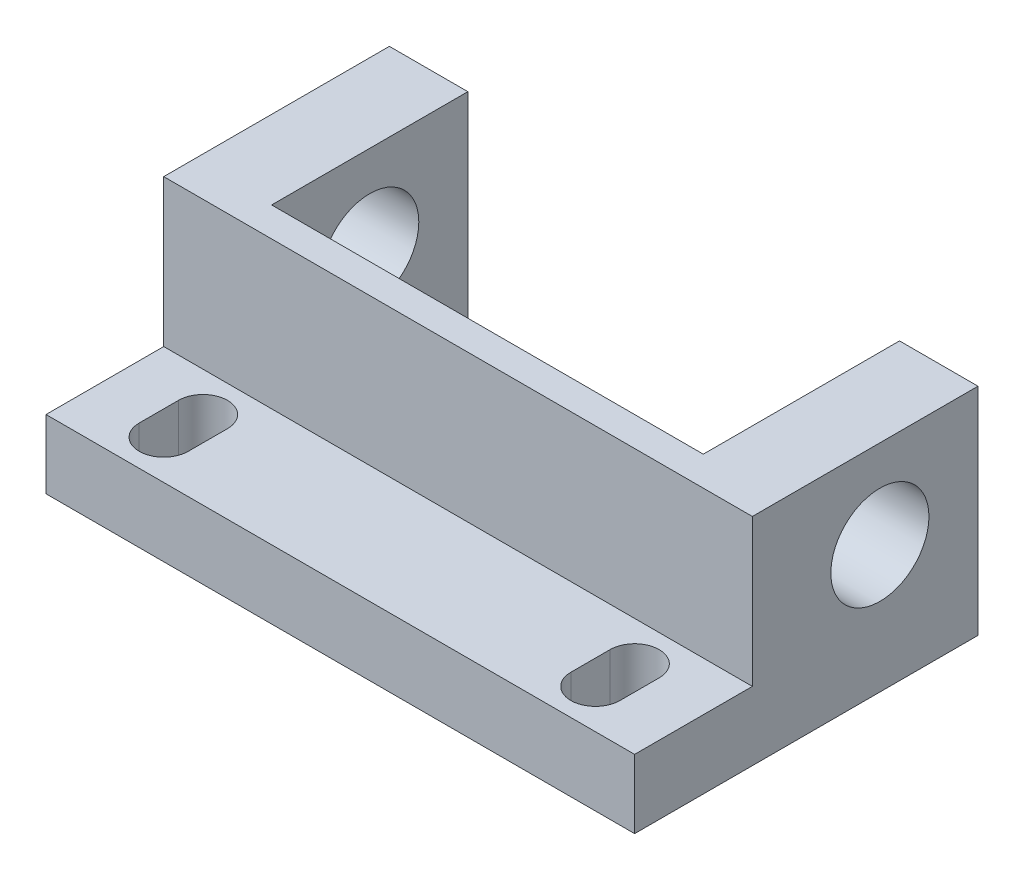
ISO-10303-21;
HEADER;
FILE_DESCRIPTION(('STEP AP214'),'2;1');
FILE_NAME('part.step','',(''),(''),'','','');
FILE_SCHEMA(('AUTOMOTIVE_DESIGN { 1 0 10303 214 1 1 1 1 }'));
ENDSEC;
DATA;
#1=APPLICATION_CONTEXT('core data for automotive mechanical design processes');
#2=APPLICATION_PROTOCOL_DEFINITION('international standard','automotive_design',2000,#1);
#3=PRODUCT_CONTEXT('',#1,'mechanical');
#4=PRODUCT('Part','Part','',(#3));
#5=PRODUCT_RELATED_PRODUCT_CATEGORY('part','',(#4));
#6=PRODUCT_DEFINITION_FORMATION('','',#4);
#7=PRODUCT_DEFINITION_CONTEXT('part definition',#1,'design');
#8=PRODUCT_DEFINITION('design','',#6,#7);
#9=PRODUCT_DEFINITION_SHAPE('','',#8);
#10=(LENGTH_UNIT() NAMED_UNIT(*) SI_UNIT(.MILLI.,.METRE.));
#11=(NAMED_UNIT(*) PLANE_ANGLE_UNIT() SI_UNIT($,.RADIAN.));
#12=(NAMED_UNIT(*) SI_UNIT($,.STERADIAN.) SOLID_ANGLE_UNIT());
#13=UNCERTAINTY_MEASURE_WITH_UNIT(LENGTH_MEASURE(1.E-05),#10,'distance_accuracy_value','');
#14=(GEOMETRIC_REPRESENTATION_CONTEXT(3) GLOBAL_UNCERTAINTY_ASSIGNED_CONTEXT((#13)) GLOBAL_UNIT_ASSIGNED_CONTEXT((#10,
#11,#12)) REPRESENTATION_CONTEXT('',''));
#15=CARTESIAN_POINT('',(0.,0.,0.));
#16=DIRECTION('',(0.,0.,1.));
#17=DIRECTION('',(1.,0.,0.));
#18=AXIS2_PLACEMENT_3D('',#15,#16,#17);
#19=CARTESIAN_POINT('',(30.,0.,-35.));
#20=DIRECTION('',(0.,0.,1.));
#21=DIRECTION('',(1.,0.,0.));
#22=AXIS2_PLACEMENT_3D('',#19,#20,#21);
#23=PLANE('',#22);
#24=DIRECTION('',(-1.,0.,0.));
#25=VECTOR('',#24,1.);
#26=CARTESIAN_POINT('',(30.,22.,-35.));
#27=LINE('',#26,#25);
#28=CARTESIAN_POINT('',(-22.,22.,-35.));
#29=VERTEX_POINT('',#28);
#30=CARTESIAN_POINT('',(-30.,22.,-35.));
#31=VERTEX_POINT('',#30);
#32=EDGE_CURVE('E290',#29,#31,#27,.T.);
#33=ORIENTED_EDGE('',*,*,#32,.F.);
#34=DIRECTION('',(0.,1.,0.));
#35=VECTOR('',#34,1.);
#36=CARTESIAN_POINT('',(-22.,0.,-35.));
#37=LINE('',#36,#35);
#38=CARTESIAN_POINT('',(-22.,0.,-35.));
#39=VERTEX_POINT('',#38);
#40=EDGE_CURVE('E270',#39,#29,#37,.T.);
#41=ORIENTED_EDGE('',*,*,#40,.F.);
#42=DIRECTION('',(-1.,0.,0.));
#43=VECTOR('',#42,1.);
#44=CARTESIAN_POINT('',(30.,0.,-35.));
#45=LINE('',#44,#43);
#46=CARTESIAN_POINT('',(-30.,0.,-35.));
#47=VERTEX_POINT('',#46);
#48=EDGE_CURVE('E303',#39,#47,#45,.T.);
#49=ORIENTED_EDGE('',*,*,#48,.T.);
#50=DIRECTION('',(0.,1.,0.));
#51=VECTOR('',#50,1.);
#52=CARTESIAN_POINT('',(-30.,0.,-35.));
#53=LINE('',#52,#51);
#54=EDGE_CURVE('E295',#47,#31,#53,.T.);
#55=ORIENTED_EDGE('',*,*,#54,.T.);
#56=EDGE_LOOP('',(#33,#41,#49,#55));
#57=FACE_BOUND('',#56,.T.);
#58=ADVANCED_FACE('F32',(#57),#23,.F.);
#59=CARTESIAN_POINT('',(30.,0.,0.));
#60=DIRECTION('',(0.,0.,-1.));
#61=DIRECTION('',(-1.,0.,0.));
#62=AXIS2_PLACEMENT_3D('',#59,#60,#61);
#63=PLANE('',#62);
#64=DIRECTION('',(0.,-1.,0.));
#65=VECTOR('',#64,1.);
#66=CARTESIAN_POINT('',(30.,0.,0.));
#67=LINE('',#66,#65);
#68=CARTESIAN_POINT('',(30.,7.,0.));
#69=VERTEX_POINT('',#68);
#70=CARTESIAN_POINT('',(30.,0.,0.));
#71=VERTEX_POINT('',#70);
#72=EDGE_CURVE('E280',#69,#71,#67,.T.);
#73=ORIENTED_EDGE('',*,*,#72,.F.);
#74=DIRECTION('',(1.,0.,0.));
#75=VECTOR('',#74,1.);
#76=CARTESIAN_POINT('',(-30.,7.,0.));
#77=LINE('',#76,#75);
#78=CARTESIAN_POINT('',(-30.,7.,0.));
#79=VERTEX_POINT('',#78);
#80=EDGE_CURVE('E234',#79,#69,#77,.T.);
#81=ORIENTED_EDGE('',*,*,#80,.F.);
#82=DIRECTION('',(0.,-1.,0.));
#83=VECTOR('',#82,1.);
#84=CARTESIAN_POINT('',(-30.,0.,0.));
#85=LINE('',#84,#83);
#86=CARTESIAN_POINT('',(-30.,0.,0.));
#87=VERTEX_POINT('',#86);
#88=EDGE_CURVE('E272',#79,#87,#85,.T.);
#89=ORIENTED_EDGE('',*,*,#88,.T.);
#90=DIRECTION('',(-1.,0.,0.));
#91=VECTOR('',#90,1.);
#92=CARTESIAN_POINT('',(30.,0.,0.));
#93=LINE('',#92,#91);
#94=EDGE_CURVE('E11',#71,#87,#93,.T.);
#95=ORIENTED_EDGE('',*,*,#94,.F.);
#96=EDGE_LOOP('',(#73,#81,#89,#95));
#97=FACE_BOUND('',#96,.T.);
#98=ADVANCED_FACE('F34',(#97),#63,.F.);
#99=CARTESIAN_POINT('',(30.,0.,0.));
#100=DIRECTION('',(0.,1.,0.));
#101=DIRECTION('',(0.,0.,1.));
#102=AXIS2_PLACEMENT_3D('',#99,#100,#101);
#103=PLANE('',#102);
#104=DIRECTION('',(0.,0.,1.));
#105=VECTOR('',#104,1.);
#106=CARTESIAN_POINT('',(19.5,0.,-4.));
#107=LINE('',#106,#105);
#108=CARTESIAN_POINT('',(19.5,0.,-8.));
#109=VERTEX_POINT('',#108);
#110=CARTESIAN_POINT('',(19.5,0.,-4.));
#111=VERTEX_POINT('',#110);
#112=EDGE_CURVE('E166',#109,#111,#107,.T.);
#113=ORIENTED_EDGE('',*,*,#112,.T.);
#114=CARTESIAN_POINT('',(22.,0.,-4.));
#115=DIRECTION('',(0.,1.,0.));
#116=DIRECTION('',(0.,0.,1.));
#117=AXIS2_PLACEMENT_3D('',#114,#115,#116);
#118=CIRCLE('',#117,2.5);
#119=CARTESIAN_POINT('',(24.5,0.,-4.));
#120=VERTEX_POINT('',#119);
#121=EDGE_CURVE('E160',#111,#120,#118,.T.);
#122=ORIENTED_EDGE('',*,*,#121,.T.);
#123=DIRECTION('',(0.,0.,-1.));
#124=VECTOR('',#123,1.);
#125=CARTESIAN_POINT('',(24.5,0.,-4.));
#126=LINE('',#125,#124);
#127=CARTESIAN_POINT('',(24.5,0.,-8.));
#128=VERTEX_POINT('',#127);
#129=EDGE_CURVE('E169',#120,#128,#126,.T.);
#130=ORIENTED_EDGE('',*,*,#129,.T.);
#131=CARTESIAN_POINT('',(22.,0.,-8.));
#132=DIRECTION('',(0.,1.,0.));
#133=DIRECTION('',(0.,0.,1.));
#134=AXIS2_PLACEMENT_3D('',#131,#132,#133);
#135=CIRCLE('',#134,2.5);
#136=EDGE_CURVE('E48',#128,#109,#135,.T.);
#137=ORIENTED_EDGE('',*,*,#136,.T.);
#138=EDGE_LOOP('',(#113,#122,#130,#137));
#139=FACE_BOUND('',#138,.T.);
#140=DIRECTION('',(0.,0.,1.));
#141=VECTOR('',#140,1.);
#142=CARTESIAN_POINT('',(-24.5,0.,-4.));
#143=LINE('',#142,#141);
#144=CARTESIAN_POINT('',(-24.5,0.,-8.));
#145=VERTEX_POINT('',#144);
#146=CARTESIAN_POINT('',(-24.5,0.,-4.));
#147=VERTEX_POINT('',#146);
#148=EDGE_CURVE('E205',#145,#147,#143,.T.);
#149=ORIENTED_EDGE('',*,*,#148,.T.);
#150=CARTESIAN_POINT('',(-22.,0.,-4.));
#151=DIRECTION('',(0.,1.,0.));
#152=DIRECTION('',(0.,0.,1.));
#153=AXIS2_PLACEMENT_3D('',#150,#151,#152);
#154=CIRCLE('',#153,2.5);
#155=CARTESIAN_POINT('',(-19.5,0.,-4.));
#156=VERTEX_POINT('',#155);
#157=EDGE_CURVE('E195',#147,#156,#154,.T.);
#158=ORIENTED_EDGE('',*,*,#157,.T.);
#159=DIRECTION('',(0.,0.,-1.));
#160=VECTOR('',#159,1.);
#161=CARTESIAN_POINT('',(-19.5,0.,-4.));
#162=LINE('',#161,#160);
#163=CARTESIAN_POINT('',(-19.5,0.,-8.));
#164=VERTEX_POINT('',#163);
#165=EDGE_CURVE('E198',#156,#164,#162,.T.);
#166=ORIENTED_EDGE('',*,*,#165,.T.);
#167=CARTESIAN_POINT('',(-22.,0.,-8.));
#168=DIRECTION('',(0.,1.,0.));
#169=DIRECTION('',(0.,0.,1.));
#170=AXIS2_PLACEMENT_3D('',#167,#168,#169);
#171=CIRCLE('',#170,2.5);
#172=EDGE_CURVE('E202',#164,#145,#171,.T.);
#173=ORIENTED_EDGE('',*,*,#172,.T.);
#174=EDGE_LOOP('',(#149,#158,#166,#173));
#175=FACE_BOUND('',#174,.T.);
#176=ORIENTED_EDGE('',*,*,#48,.F.);
#177=DIRECTION('',(0.,0.,1.));
#178=VECTOR('',#177,1.);
#179=CARTESIAN_POINT('',(-22.,0.,-35.));
#180=LINE('',#179,#178);
#181=CARTESIAN_POINT('',(-22.,0.,-15.));
#182=VERTEX_POINT('',#181);
#183=EDGE_CURVE('E254',#39,#182,#180,.T.);
#184=ORIENTED_EDGE('',*,*,#183,.T.);
#185=DIRECTION('',(1.,0.,0.));
#186=VECTOR('',#185,1.);
#187=CARTESIAN_POINT('',(-22.,0.,-15.));
#188=LINE('',#187,#186);
#189=CARTESIAN_POINT('',(22.,0.,-15.));
#190=VERTEX_POINT('',#189);
#191=EDGE_CURVE('E257',#182,#190,#188,.T.);
#192=ORIENTED_EDGE('',*,*,#191,.T.);
#193=DIRECTION('',(0.,0.,-1.));
#194=VECTOR('',#193,1.);
#195=CARTESIAN_POINT('',(22.,0.,-35.));
#196=LINE('',#195,#194);
#197=CARTESIAN_POINT('',(22.,0.,-35.));
#198=VERTEX_POINT('',#197);
#199=EDGE_CURVE('E261',#190,#198,#196,.T.);
#200=ORIENTED_EDGE('',*,*,#199,.T.);
#201=CARTESIAN_POINT('',(30.,0.,-35.));
#202=VERTEX_POINT('',#201);
#203=EDGE_CURVE('E41',#202,#198,#45,.T.);
#204=ORIENTED_EDGE('',*,*,#203,.F.);
#205=DIRECTION('',(0.,0.,-1.));
#206=VECTOR('',#205,1.);
#207=CARTESIAN_POINT('',(30.,0.,0.));
#208=LINE('',#207,#206);
#209=EDGE_CURVE('E282',#71,#202,#208,.T.);
#210=ORIENTED_EDGE('',*,*,#209,.F.);
#211=ORIENTED_EDGE('',*,*,#94,.T.);
#212=DIRECTION('',(0.,0.,-1.));
#213=VECTOR('',#212,1.);
#214=CARTESIAN_POINT('',(-30.,0.,0.));
#215=LINE('',#214,#213);
#216=EDGE_CURVE('E292',#87,#47,#215,.T.);
#217=ORIENTED_EDGE('',*,*,#216,.T.);
#218=EDGE_LOOP('',(#176,#184,#192,#200,#204,#210,#211,#217));
#219=FACE_BOUND('',#218,.T.);
#220=ADVANCED_FACE('F173',(#139,#175,#219),#103,.F.);
#221=ORIENTED_EDGE('',*,*,#203,.T.);
#222=DIRECTION('',(0.,1.,0.));
#223=VECTOR('',#222,1.);
#224=CARTESIAN_POINT('',(22.,0.,-35.));
#225=LINE('',#224,#223);
#226=CARTESIAN_POINT('',(22.,22.,-35.));
#227=VERTEX_POINT('',#226);
#228=EDGE_CURVE('E273',#198,#227,#225,.T.);
#229=ORIENTED_EDGE('',*,*,#228,.T.);
#230=CARTESIAN_POINT('',(30.,22.,-35.));
#231=VERTEX_POINT('',#230);
#232=EDGE_CURVE('E300',#231,#227,#27,.T.);
#233=ORIENTED_EDGE('',*,*,#232,.F.);
#234=DIRECTION('',(0.,1.,0.));
#235=VECTOR('',#234,1.);
#236=CARTESIAN_POINT('',(30.,0.,-35.));
#237=LINE('',#236,#235);
#238=EDGE_CURVE('E285',#202,#231,#237,.T.);
#239=ORIENTED_EDGE('',*,*,#238,.F.);
#240=EDGE_LOOP('',(#221,#229,#233,#239));
#241=FACE_BOUND('',#240,.T.);
#242=ADVANCED_FACE('F337',(#241),#23,.F.);
#243=CARTESIAN_POINT('',(30.,22.,0.));
#244=DIRECTION('',(0.,-1.,0.));
#245=DIRECTION('',(0.,0.,-1.));
#246=AXIS2_PLACEMENT_3D('',#243,#244,#245);
#247=PLANE('',#246);
#248=DIRECTION('',(0.,0.,1.));
#249=VECTOR('',#248,1.);
#250=CARTESIAN_POINT('',(-30.,22.,0.));
#251=LINE('',#250,#249);
#252=CARTESIAN_POINT('',(-30.,22.,-12.));
#253=VERTEX_POINT('',#252);
#254=EDGE_CURVE('E283',#31,#253,#251,.T.);
#255=ORIENTED_EDGE('',*,*,#254,.T.);
#256=DIRECTION('',(1.,0.,0.));
#257=VECTOR('',#256,1.);
#258=CARTESIAN_POINT('',(-30.,22.,-12.));
#259=LINE('',#258,#257);
#260=CARTESIAN_POINT('',(30.,22.,-12.));
#261=VERTEX_POINT('',#260);
#262=EDGE_CURVE('E238',#253,#261,#259,.T.);
#263=ORIENTED_EDGE('',*,*,#262,.T.);
#264=DIRECTION('',(0.,0.,1.));
#265=VECTOR('',#264,1.);
#266=CARTESIAN_POINT('',(30.,22.,0.));
#267=LINE('',#266,#265);
#268=EDGE_CURVE('E287',#231,#261,#267,.T.);
#269=ORIENTED_EDGE('',*,*,#268,.F.);
#270=ORIENTED_EDGE('',*,*,#232,.T.);
#271=DIRECTION('',(0.,0.,-1.));
#272=VECTOR('',#271,1.);
#273=CARTESIAN_POINT('',(22.,22.,-35.));
#274=LINE('',#273,#272);
#275=CARTESIAN_POINT('',(22.,22.,-15.));
#276=VERTEX_POINT('',#275);
#277=EDGE_CURVE('E258',#276,#227,#274,.T.);
#278=ORIENTED_EDGE('',*,*,#277,.F.);
#279=DIRECTION('',(1.,0.,0.));
#280=VECTOR('',#279,1.);
#281=CARTESIAN_POINT('',(-22.,22.,-15.));
#282=LINE('',#281,#280);
#283=CARTESIAN_POINT('',(-22.,22.,-15.));
#284=VERTEX_POINT('',#283);
#285=EDGE_CURVE('E266',#284,#276,#282,.T.);
#286=ORIENTED_EDGE('',*,*,#285,.F.);
#287=DIRECTION('',(0.,0.,1.));
#288=VECTOR('',#287,1.);
#289=CARTESIAN_POINT('',(-22.,22.,-35.));
#290=LINE('',#289,#288);
#291=EDGE_CURVE('E253',#29,#284,#290,.T.);
#292=ORIENTED_EDGE('',*,*,#291,.F.);
#293=ORIENTED_EDGE('',*,*,#32,.T.);
#294=EDGE_LOOP('',(#255,#263,#269,#270,#278,#286,#292,#293));
#295=FACE_BOUND('',#294,.T.);
#296=ADVANCED_FACE('F323',(#295),#247,.F.);
#297=CARTESIAN_POINT('',(30.,0.,0.));
#298=DIRECTION('',(-1.,0.,0.));
#299=DIRECTION('',(0.,0.,1.));
#300=AXIS2_PLACEMENT_3D('',#297,#298,#299);
#301=PLANE('',#300);
#302=CARTESIAN_POINT('',(30.,13.,-25.));
#303=DIRECTION('',(1.,0.,0.));
#304=DIRECTION('',(0.,0.,-1.));
#305=AXIS2_PLACEMENT_3D('',#302,#303,#304);
#306=CIRCLE('',#305,5.);
#307=CARTESIAN_POINT('',(30.,13.,-30.));
#308=VERTEX_POINT('',#307);
#309=EDGE_CURVE('E241',#308,#308,#306,.T.);
#310=ORIENTED_EDGE('',*,*,#309,.F.);
#311=EDGE_LOOP('',(#310));
#312=FACE_BOUND('',#311,.T.);
#313=ORIENTED_EDGE('',*,*,#268,.T.);
#314=DIRECTION('',(0.,1.,0.));
#315=VECTOR('',#314,1.);
#316=CARTESIAN_POINT('',(30.,7.,-12.));
#317=LINE('',#316,#315);
#318=CARTESIAN_POINT('',(30.,7.,-12.));
#319=VERTEX_POINT('',#318);
#320=EDGE_CURVE('E231',#319,#261,#317,.T.);
#321=ORIENTED_EDGE('',*,*,#320,.F.);
#322=DIRECTION('',(0.,0.,-1.));
#323=VECTOR('',#322,1.);
#324=CARTESIAN_POINT('',(30.,7.,0.));
#325=LINE('',#324,#323);
#326=EDGE_CURVE('E220',#69,#319,#325,.T.);
#327=ORIENTED_EDGE('',*,*,#326,.F.);
#328=ORIENTED_EDGE('',*,*,#72,.T.);
#329=ORIENTED_EDGE('',*,*,#209,.T.);
#330=ORIENTED_EDGE('',*,*,#238,.T.);
#331=EDGE_LOOP('',(#313,#321,#327,#328,#329,#330));
#332=FACE_BOUND('',#331,.T.);
#333=ADVANCED_FACE('F340',(#312,#332),#301,.F.);
#334=CARTESIAN_POINT('',(-30.,0.,0.));
#335=DIRECTION('',(-1.,0.,0.));
#336=DIRECTION('',(0.,0.,1.));
#337=AXIS2_PLACEMENT_3D('',#334,#335,#336);
#338=PLANE('',#337);
#339=DIRECTION('',(0.,1.,0.));
#340=VECTOR('',#339,1.);
#341=CARTESIAN_POINT('',(-30.,7.,-12.));
#342=LINE('',#341,#340);
#343=CARTESIAN_POINT('',(-30.,7.,-12.));
#344=VERTEX_POINT('',#343);
#345=EDGE_CURVE('E230',#344,#253,#342,.T.);
#346=ORIENTED_EDGE('',*,*,#345,.T.);
#347=ORIENTED_EDGE('',*,*,#254,.F.);
#348=ORIENTED_EDGE('',*,*,#54,.F.);
#349=ORIENTED_EDGE('',*,*,#216,.F.);
#350=ORIENTED_EDGE('',*,*,#88,.F.);
#351=DIRECTION('',(0.,0.,-1.));
#352=VECTOR('',#351,1.);
#353=CARTESIAN_POINT('',(-30.,7.,0.));
#354=LINE('',#353,#352);
#355=EDGE_CURVE('E227',#79,#344,#354,.T.);
#356=ORIENTED_EDGE('',*,*,#355,.T.);
#357=EDGE_LOOP('',(#346,#347,#348,#349,#350,#356));
#358=FACE_BOUND('',#357,.T.);
#359=CARTESIAN_POINT('',(-30.,13.,-25.));
#360=DIRECTION('',(1.,0.,0.));
#361=DIRECTION('',(0.,0.,-1.));
#362=AXIS2_PLACEMENT_3D('',#359,#360,#361);
#363=CIRCLE('',#362,5.);
#364=CARTESIAN_POINT('',(-30.,13.,-30.));
#365=VERTEX_POINT('',#364);
#366=EDGE_CURVE('E245',#365,#365,#363,.T.);
#367=ORIENTED_EDGE('',*,*,#366,.T.);
#368=EDGE_LOOP('',(#367));
#369=FACE_BOUND('',#368,.T.);
#370=ADVANCED_FACE('F320',(#358,#369),#338,.T.);
#371=CARTESIAN_POINT('',(-22.,0.,-35.));
#372=DIRECTION('',(-1.,0.,0.));
#373=DIRECTION('',(0.,0.,1.));
#374=AXIS2_PLACEMENT_3D('',#371,#372,#373);
#375=PLANE('',#374);
#376=CARTESIAN_POINT('',(-22.,13.,-25.));
#377=DIRECTION('',(-1.,0.,0.));
#378=DIRECTION('',(0.,0.,1.));
#379=AXIS2_PLACEMENT_3D('',#376,#377,#378);
#380=CIRCLE('',#379,5.);
#381=CARTESIAN_POINT('',(-22.,13.,-20.));
#382=VERTEX_POINT('',#381);
#383=EDGE_CURVE('E250',#382,#382,#380,.T.);
#384=ORIENTED_EDGE('',*,*,#383,.T.);
#385=EDGE_LOOP('',(#384));
#386=FACE_BOUND('',#385,.T.);
#387=ORIENTED_EDGE('',*,*,#291,.T.);
#388=DIRECTION('',(0.,1.,0.));
#389=VECTOR('',#388,1.);
#390=CARTESIAN_POINT('',(-22.,0.,-15.));
#391=LINE('',#390,#389);
#392=EDGE_CURVE('E264',#182,#284,#391,.T.);
#393=ORIENTED_EDGE('',*,*,#392,.F.);
#394=ORIENTED_EDGE('',*,*,#183,.F.);
#395=ORIENTED_EDGE('',*,*,#40,.T.);
#396=EDGE_LOOP('',(#387,#393,#394,#395));
#397=FACE_BOUND('',#396,.T.);
#398=ADVANCED_FACE('F329',(#386,#397),#375,.F.);
#399=CARTESIAN_POINT('',(22.,0.,-35.));
#400=DIRECTION('',(1.,0.,0.));
#401=DIRECTION('',(0.,0.,-1.));
#402=AXIS2_PLACEMENT_3D('',#399,#400,#401);
#403=PLANE('',#402);
#404=CARTESIAN_POINT('',(22.,13.,-25.));
#405=DIRECTION('',(1.,0.,0.));
#406=DIRECTION('',(0.,0.,-1.));
#407=AXIS2_PLACEMENT_3D('',#404,#405,#406);
#408=CIRCLE('',#407,5.);
#409=CARTESIAN_POINT('',(22.,13.,-30.));
#410=VERTEX_POINT('',#409);
#411=EDGE_CURVE('E36',#410,#410,#408,.T.);
#412=ORIENTED_EDGE('',*,*,#411,.T.);
#413=EDGE_LOOP('',(#412));
#414=FACE_BOUND('',#413,.T.);
#415=ORIENTED_EDGE('',*,*,#277,.T.);
#416=ORIENTED_EDGE('',*,*,#228,.F.);
#417=ORIENTED_EDGE('',*,*,#199,.F.);
#418=DIRECTION('',(0.,1.,0.));
#419=VECTOR('',#418,1.);
#420=CARTESIAN_POINT('',(22.,0.,-15.));
#421=LINE('',#420,#419);
#422=EDGE_CURVE('E276',#190,#276,#421,.T.);
#423=ORIENTED_EDGE('',*,*,#422,.T.);
#424=EDGE_LOOP('',(#415,#416,#417,#423));
#425=FACE_BOUND('',#424,.T.);
#426=ADVANCED_FACE('F335',(#414,#425),#403,.F.);
#427=CARTESIAN_POINT('',(-22.,0.,-15.));
#428=DIRECTION('',(0.,0.,1.));
#429=DIRECTION('',(1.,0.,0.));
#430=AXIS2_PLACEMENT_3D('',#427,#428,#429);
#431=PLANE('',#430);
#432=ORIENTED_EDGE('',*,*,#285,.T.);
#433=ORIENTED_EDGE('',*,*,#422,.F.);
#434=ORIENTED_EDGE('',*,*,#191,.F.);
#435=ORIENTED_EDGE('',*,*,#392,.T.);
#436=EDGE_LOOP('',(#432,#433,#434,#435));
#437=FACE_BOUND('',#436,.T.);
#438=ADVANCED_FACE('F332',(#437),#431,.F.);
#439=CARTESIAN_POINT('',(-30.,13.,-25.));
#440=DIRECTION('',(1.,0.,0.));
#441=DIRECTION('',(0.,0.,-1.));
#442=AXIS2_PLACEMENT_3D('',#439,#440,#441);
#443=CYLINDRICAL_SURFACE('',#442,5.);
#444=ORIENTED_EDGE('',*,*,#309,.T.);
#445=EDGE_LOOP('',(#444));
#446=FACE_BOUND('',#445,.T.);
#447=ORIENTED_EDGE('',*,*,#411,.F.);
#448=EDGE_LOOP('',(#447));
#449=FACE_BOUND('',#448,.T.);
#450=ADVANCED_FACE('F360',(#446,#449),#443,.F.);
#451=ORIENTED_EDGE('',*,*,#366,.F.);
#452=EDGE_LOOP('',(#451));
#453=FACE_BOUND('',#452,.T.);
#454=ORIENTED_EDGE('',*,*,#383,.F.);
#455=EDGE_LOOP('',(#454));
#456=FACE_BOUND('',#455,.T.);
#457=ADVANCED_FACE('F351',(#453,#456),#443,.F.);
#458=CARTESIAN_POINT('',(-30.,7.,-12.));
#459=DIRECTION('',(0.,0.,-1.));
#460=DIRECTION('',(-1.,0.,0.));
#461=AXIS2_PLACEMENT_3D('',#458,#459,#460);
#462=PLANE('',#461);
#463=ORIENTED_EDGE('',*,*,#320,.T.);
#464=ORIENTED_EDGE('',*,*,#262,.F.);
#465=ORIENTED_EDGE('',*,*,#345,.F.);
#466=DIRECTION('',(1.,0.,0.));
#467=VECTOR('',#466,1.);
#468=CARTESIAN_POINT('',(-30.,7.,-12.));
#469=LINE('',#468,#467);
#470=EDGE_CURVE('E242',#344,#319,#469,.T.);
#471=ORIENTED_EDGE('',*,*,#470,.T.);
#472=EDGE_LOOP('',(#463,#464,#465,#471));
#473=FACE_BOUND('',#472,.T.);
#474=ADVANCED_FACE('F349',(#473),#462,.F.);
#475=CARTESIAN_POINT('',(-30.,7.,0.));
#476=DIRECTION('',(0.,-1.,0.));
#477=DIRECTION('',(0.,0.,-1.));
#478=AXIS2_PLACEMENT_3D('',#475,#476,#477);
#479=PLANE('',#478);
#480=DIRECTION('',(0.,0.,-1.));
#481=VECTOR('',#480,1.);
#482=CARTESIAN_POINT('',(24.5,7.,-4.));
#483=LINE('',#482,#481);
#484=CARTESIAN_POINT('',(24.5,7.,-4.));
#485=VERTEX_POINT('',#484);
#486=CARTESIAN_POINT('',(24.5,7.,-8.));
#487=VERTEX_POINT('',#486);
#488=EDGE_CURVE('E185',#485,#487,#483,.T.);
#489=ORIENTED_EDGE('',*,*,#488,.F.);
#490=CARTESIAN_POINT('',(22.,7.,-4.));
#491=DIRECTION('',(0.,1.,0.));
#492=DIRECTION('',(0.,0.,1.));
#493=AXIS2_PLACEMENT_3D('',#490,#491,#492);
#494=CIRCLE('',#493,2.5);
#495=CARTESIAN_POINT('',(19.5,7.,-4.));
#496=VERTEX_POINT('',#495);
#497=EDGE_CURVE('E56',#496,#485,#494,.T.);
#498=ORIENTED_EDGE('',*,*,#497,.F.);
#499=DIRECTION('',(0.,0.,1.));
#500=VECTOR('',#499,1.);
#501=CARTESIAN_POINT('',(19.5,7.,-4.));
#502=LINE('',#501,#500);
#503=CARTESIAN_POINT('',(19.5,7.,-8.));
#504=VERTEX_POINT('',#503);
#505=EDGE_CURVE('E176',#504,#496,#502,.T.);
#506=ORIENTED_EDGE('',*,*,#505,.F.);
#507=CARTESIAN_POINT('',(22.,7.,-8.));
#508=DIRECTION('',(0.,1.,0.));
#509=DIRECTION('',(0.,0.,1.));
#510=AXIS2_PLACEMENT_3D('',#507,#508,#509);
#511=CIRCLE('',#510,2.5);
#512=EDGE_CURVE('E179',#487,#504,#511,.T.);
#513=ORIENTED_EDGE('',*,*,#512,.F.);
#514=EDGE_LOOP('',(#489,#498,#506,#513));
#515=FACE_BOUND('',#514,.T.);
#516=DIRECTION('',(0.,0.,-1.));
#517=VECTOR('',#516,1.);
#518=CARTESIAN_POINT('',(-19.5,7.,-4.));
#519=LINE('',#518,#517);
#520=CARTESIAN_POINT('',(-19.5,7.,-4.));
#521=VERTEX_POINT('',#520);
#522=CARTESIAN_POINT('',(-19.5,7.,-8.));
#523=VERTEX_POINT('',#522);
#524=EDGE_CURVE('E210',#521,#523,#519,.T.);
#525=ORIENTED_EDGE('',*,*,#524,.F.);
#526=CARTESIAN_POINT('',(-22.,7.,-4.));
#527=DIRECTION('',(0.,1.,0.));
#528=DIRECTION('',(0.,0.,1.));
#529=AXIS2_PLACEMENT_3D('',#526,#527,#528);
#530=CIRCLE('',#529,2.5);
#531=CARTESIAN_POINT('',(-24.5,7.,-4.));
#532=VERTEX_POINT('',#531);
#533=EDGE_CURVE('E191',#532,#521,#530,.T.);
#534=ORIENTED_EDGE('',*,*,#533,.F.);
#535=DIRECTION('',(0.,0.,1.));
#536=VECTOR('',#535,1.);
#537=CARTESIAN_POINT('',(-24.5,7.,-4.));
#538=LINE('',#537,#536);
#539=CARTESIAN_POINT('',(-24.5,7.,-8.));
#540=VERTEX_POINT('',#539);
#541=EDGE_CURVE('E199',#540,#532,#538,.T.);
#542=ORIENTED_EDGE('',*,*,#541,.F.);
#543=CARTESIAN_POINT('',(-22.,7.,-8.));
#544=DIRECTION('',(0.,1.,0.));
#545=DIRECTION('',(0.,0.,1.));
#546=AXIS2_PLACEMENT_3D('',#543,#544,#545);
#547=CIRCLE('',#546,2.5);
#548=EDGE_CURVE('E213',#523,#540,#547,.T.);
#549=ORIENTED_EDGE('',*,*,#548,.F.);
#550=EDGE_LOOP('',(#525,#534,#542,#549));
#551=FACE_BOUND('',#550,.T.);
#552=ORIENTED_EDGE('',*,*,#326,.T.);
#553=ORIENTED_EDGE('',*,*,#470,.F.);
#554=ORIENTED_EDGE('',*,*,#355,.F.);
#555=ORIENTED_EDGE('',*,*,#80,.T.);
#556=EDGE_LOOP('',(#552,#553,#554,#555));
#557=FACE_BOUND('',#556,.T.);
#558=ADVANCED_FACE('F347',(#515,#551,#557),#479,.F.);
#559=CARTESIAN_POINT('',(-22.,0.,-4.));
#560=DIRECTION('',(0.,1.,0.));
#561=DIRECTION('',(0.,0.,1.));
#562=AXIS2_PLACEMENT_3D('',#559,#560,#561);
#563=CYLINDRICAL_SURFACE('',#562,2.5);
#564=ORIENTED_EDGE('',*,*,#533,.T.);
#565=DIRECTION('',(0.,1.,0.));
#566=VECTOR('',#565,1.);
#567=CARTESIAN_POINT('',(-19.5,0.,-4.));
#568=LINE('',#567,#566);
#569=EDGE_CURVE('E208',#156,#521,#568,.T.);
#570=ORIENTED_EDGE('',*,*,#569,.F.);
#571=ORIENTED_EDGE('',*,*,#157,.F.);
#572=DIRECTION('',(0.,1.,0.));
#573=VECTOR('',#572,1.);
#574=CARTESIAN_POINT('',(-24.5,0.,-4.));
#575=LINE('',#574,#573);
#576=EDGE_CURVE('E218',#147,#532,#575,.T.);
#577=ORIENTED_EDGE('',*,*,#576,.T.);
#578=EDGE_LOOP('',(#564,#570,#571,#577));
#579=FACE_BOUND('',#578,.T.);
#580=ADVANCED_FACE('F357',(#579),#563,.F.);
#581=CARTESIAN_POINT('',(-24.5,0.,-4.));
#582=DIRECTION('',(-1.,0.,0.));
#583=DIRECTION('',(0.,0.,1.));
#584=AXIS2_PLACEMENT_3D('',#581,#582,#583);
#585=PLANE('',#584);
#586=ORIENTED_EDGE('',*,*,#541,.T.);
#587=ORIENTED_EDGE('',*,*,#576,.F.);
#588=ORIENTED_EDGE('',*,*,#148,.F.);
#589=DIRECTION('',(0.,1.,0.));
#590=VECTOR('',#589,1.);
#591=CARTESIAN_POINT('',(-24.5,0.,-8.));
#592=LINE('',#591,#590);
#593=EDGE_CURVE('E221',#145,#540,#592,.T.);
#594=ORIENTED_EDGE('',*,*,#593,.T.);
#595=EDGE_LOOP('',(#586,#587,#588,#594));
#596=FACE_BOUND('',#595,.T.);
#597=ADVANCED_FACE('F433',(#596),#585,.F.);
#598=CARTESIAN_POINT('',(-22.,0.,-8.));
#599=DIRECTION('',(0.,1.,0.));
#600=DIRECTION('',(0.,0.,1.));
#601=AXIS2_PLACEMENT_3D('',#598,#599,#600);
#602=CYLINDRICAL_SURFACE('',#601,2.5);
#603=ORIENTED_EDGE('',*,*,#548,.T.);
#604=ORIENTED_EDGE('',*,*,#593,.F.);
#605=ORIENTED_EDGE('',*,*,#172,.F.);
#606=DIRECTION('',(0.,1.,0.));
#607=VECTOR('',#606,1.);
#608=CARTESIAN_POINT('',(-19.5,0.,-8.));
#609=LINE('',#608,#607);
#610=EDGE_CURVE('E223',#164,#523,#609,.T.);
#611=ORIENTED_EDGE('',*,*,#610,.T.);
#612=EDGE_LOOP('',(#603,#604,#605,#611));
#613=FACE_BOUND('',#612,.T.);
#614=ADVANCED_FACE('F441',(#613),#602,.F.);
#615=CARTESIAN_POINT('',(-19.5,0.,-4.));
#616=DIRECTION('',(1.,0.,0.));
#617=DIRECTION('',(0.,0.,-1.));
#618=AXIS2_PLACEMENT_3D('',#615,#616,#617);
#619=PLANE('',#618);
#620=ORIENTED_EDGE('',*,*,#524,.T.);
#621=ORIENTED_EDGE('',*,*,#610,.F.);
#622=ORIENTED_EDGE('',*,*,#165,.F.);
#623=ORIENTED_EDGE('',*,*,#569,.T.);
#624=EDGE_LOOP('',(#620,#621,#622,#623));
#625=FACE_BOUND('',#624,.T.);
#626=ADVANCED_FACE('F450',(#625),#619,.F.);
#627=CARTESIAN_POINT('',(22.,0.,-4.));
#628=DIRECTION('',(0.,1.,0.));
#629=DIRECTION('',(0.,0.,1.));
#630=AXIS2_PLACEMENT_3D('',#627,#628,#629);
#631=CYLINDRICAL_SURFACE('',#630,2.5);
#632=ORIENTED_EDGE('',*,*,#497,.T.);
#633=DIRECTION('',(0.,1.,0.));
#634=VECTOR('',#633,1.);
#635=CARTESIAN_POINT('',(24.5,0.,-4.));
#636=LINE('',#635,#634);
#637=EDGE_CURVE('E156',#120,#485,#636,.T.);
#638=ORIENTED_EDGE('',*,*,#637,.F.);
#639=ORIENTED_EDGE('',*,*,#121,.F.);
#640=DIRECTION('',(0.,1.,0.));
#641=VECTOR('',#640,1.);
#642=CARTESIAN_POINT('',(19.5,0.,-4.));
#643=LINE('',#642,#641);
#644=EDGE_CURVE('E189',#111,#496,#643,.T.);
#645=ORIENTED_EDGE('',*,*,#644,.T.);
#646=EDGE_LOOP('',(#632,#638,#639,#645));
#647=FACE_BOUND('',#646,.T.);
#648=ADVANCED_FACE('F158',(#647),#631,.F.);
#649=CARTESIAN_POINT('',(19.5,0.,-4.));
#650=DIRECTION('',(-1.,0.,0.));
#651=DIRECTION('',(0.,0.,1.));
#652=AXIS2_PLACEMENT_3D('',#649,#650,#651);
#653=PLANE('',#652);
#654=ORIENTED_EDGE('',*,*,#505,.T.);
#655=ORIENTED_EDGE('',*,*,#644,.F.);
#656=ORIENTED_EDGE('',*,*,#112,.F.);
#657=DIRECTION('',(0.,1.,0.));
#658=VECTOR('',#657,1.);
#659=CARTESIAN_POINT('',(19.5,0.,-8.));
#660=LINE('',#659,#658);
#661=EDGE_CURVE('E192',#109,#504,#660,.T.);
#662=ORIENTED_EDGE('',*,*,#661,.T.);
#663=EDGE_LOOP('',(#654,#655,#656,#662));
#664=FACE_BOUND('',#663,.T.);
#665=ADVANCED_FACE('F467',(#664),#653,.F.);
#666=CARTESIAN_POINT('',(22.,0.,-8.));
#667=DIRECTION('',(0.,1.,0.));
#668=DIRECTION('',(0.,0.,1.));
#669=AXIS2_PLACEMENT_3D('',#666,#667,#668);
#670=CYLINDRICAL_SURFACE('',#669,2.5);
#671=ORIENTED_EDGE('',*,*,#512,.T.);
#672=ORIENTED_EDGE('',*,*,#661,.F.);
#673=ORIENTED_EDGE('',*,*,#136,.F.);
#674=DIRECTION('',(0.,1.,0.));
#675=VECTOR('',#674,1.);
#676=CARTESIAN_POINT('',(24.5,0.,-8.));
#677=LINE('',#676,#675);
#678=EDGE_CURVE('E165',#128,#487,#677,.T.);
#679=ORIENTED_EDGE('',*,*,#678,.T.);
#680=EDGE_LOOP('',(#671,#672,#673,#679));
#681=FACE_BOUND('',#680,.T.);
#682=ADVANCED_FACE('F475',(#681),#670,.F.);
#683=CARTESIAN_POINT('',(24.5,0.,-4.));
#684=DIRECTION('',(1.,0.,0.));
#685=DIRECTION('',(0.,0.,-1.));
#686=AXIS2_PLACEMENT_3D('',#683,#684,#685);
#687=PLANE('',#686);
#688=ORIENTED_EDGE('',*,*,#488,.T.);
#689=ORIENTED_EDGE('',*,*,#678,.F.);
#690=ORIENTED_EDGE('',*,*,#129,.F.);
#691=ORIENTED_EDGE('',*,*,#637,.T.);
#692=EDGE_LOOP('',(#688,#689,#690,#691));
#693=FACE_BOUND('',#692,.T.);
#694=ADVANCED_FACE('F170',(#693),#687,.F.);
#695=CLOSED_SHELL('',(#58,#98,#220,#242,#296,#333,#370,#398,#426,#438,#450,#457,#474,#558,#580,
#597,#614,#626,#648,#665,#682,#694));
#696=MANIFOLD_SOLID_BREP('B2',#695);
#697=ADVANCED_BREP_SHAPE_REPRESENTATION('',(#18,#696),#14);
#698=SHAPE_DEFINITION_REPRESENTATION(#9,#697);
ENDSEC;
END-ISO-10303-21;
